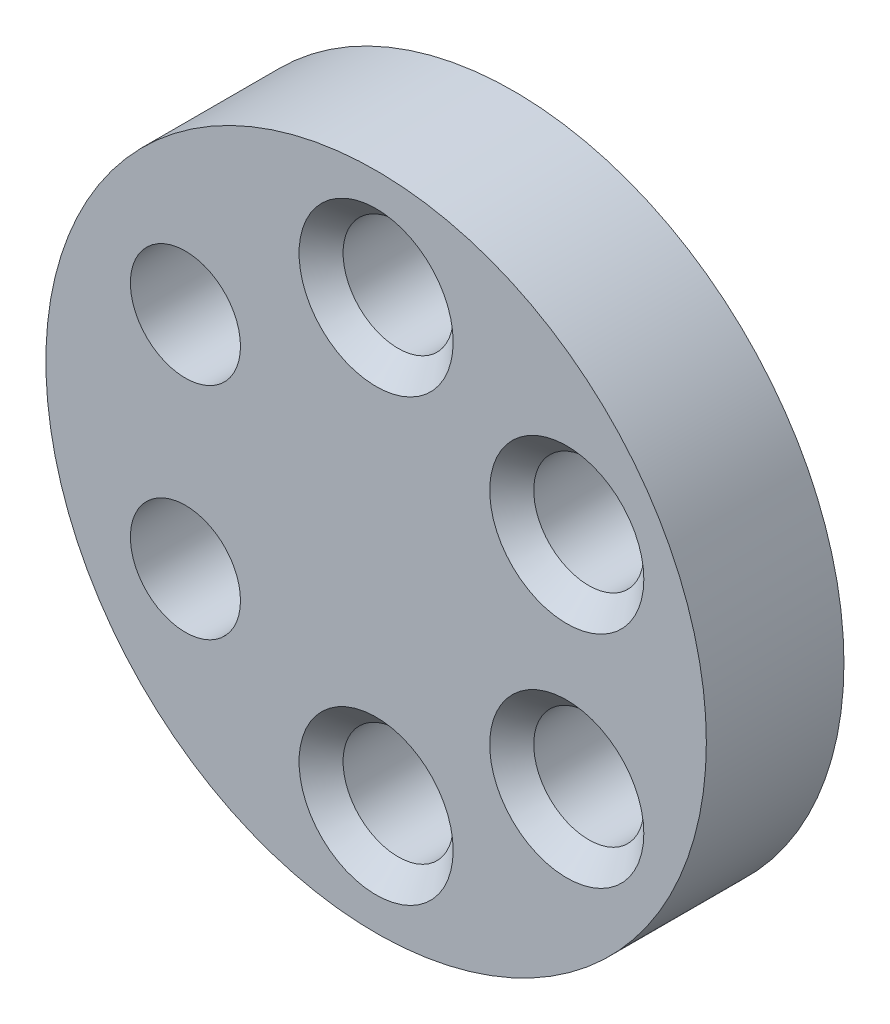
from build123d import *

# Parameters (mm, degrees)
SZKIC1_R                    = 60
SZKIC1_R_2                  = 10
DODANIE_WYCI_GNI_CIE1_DEPTH = 25
SFAZOWANIE1_SIZE            = 4


with BuildPart() as part:
    # Szkic1 → Dodanie-wyci_gni_cie1 (new body)
    with BuildSketch(Plane.XY):
        Circle(SZKIC1_R)
        with Locations((0, 40)):
            Circle(SZKIC1_R_2, mode=Mode.SUBTRACT)
        with Locations((34.641016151, 20)):
            Circle(SZKIC1_R_2, mode=Mode.SUBTRACT)
        with Locations((34.641016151, -20)):
            Circle(SZKIC1_R_2, mode=Mode.SUBTRACT)
        with Locations((0, -40)):
            Circle(SZKIC1_R_2, mode=Mode.SUBTRACT)
        with Locations((-34.641016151, -20)):
            Circle(SZKIC1_R_2, mode=Mode.SUBTRACT)
        with Locations((-34.641016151, 20)):
            Circle(SZKIC1_R_2, mode=Mode.SUBTRACT)
    extrude(amount=DODANIE_WYCI_GNI_CIE1_DEPTH)

    # Sfazowanie1
    sfazowanie1_edges = [part.edges().sort_by_distance(p)[0] for p in [
        (24.641016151, 20, 0),
        (24.641016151, 20, 25),
        (24.641016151, -20, 0),
        (24.641016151, -20, 25),
        (-10, -40, 0),
        (-10, -40, 25),
        (-10, 40, 0),
        (-10, 40, 25),
    ]]
    chamfer(sfazowanie1_edges, length=SFAZOWANIE1_SIZE)


solid = part.part
